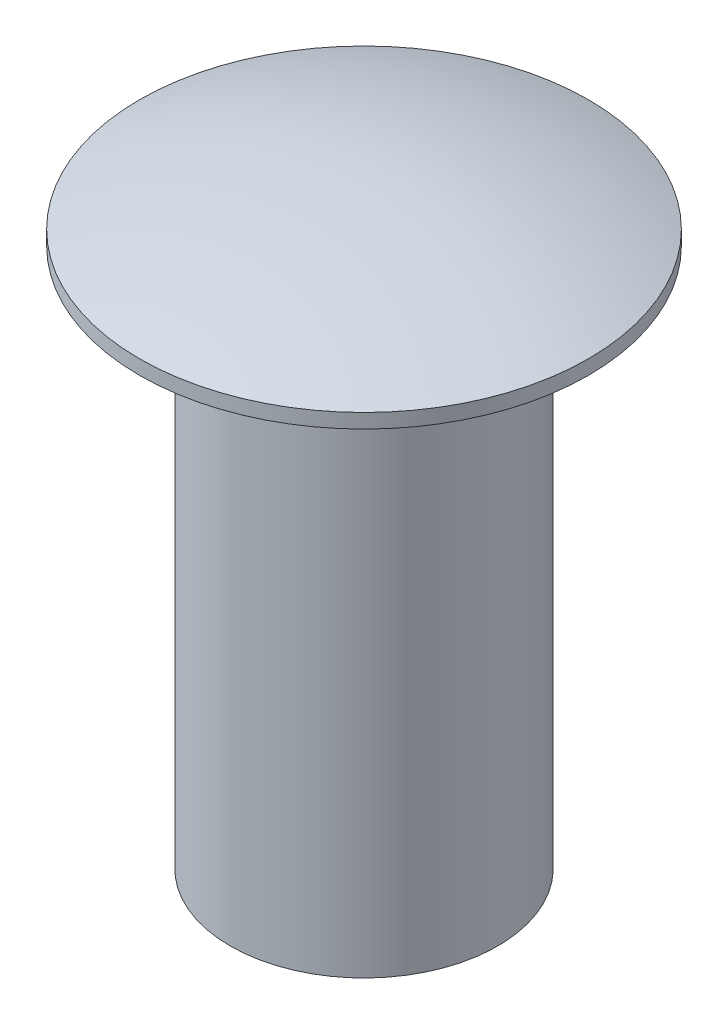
ISO-10303-21;
HEADER;
FILE_DESCRIPTION(('STEP AP214'),'2;1');
FILE_NAME('part.step','',(''),(''),'','','');
FILE_SCHEMA(('AUTOMOTIVE_DESIGN { 1 0 10303 214 1 1 1 1 }'));
ENDSEC;
DATA;
#1=APPLICATION_CONTEXT('core data for automotive mechanical design processes');
#2=APPLICATION_PROTOCOL_DEFINITION('international standard','automotive_design',2000,#1);
#3=PRODUCT_CONTEXT('',#1,'mechanical');
#4=PRODUCT('Part','Part','',(#3));
#5=PRODUCT_RELATED_PRODUCT_CATEGORY('part','',(#4));
#6=PRODUCT_DEFINITION_FORMATION('','',#4);
#7=PRODUCT_DEFINITION_CONTEXT('part definition',#1,'design');
#8=PRODUCT_DEFINITION('design','',#6,#7);
#9=PRODUCT_DEFINITION_SHAPE('','',#8);
#10=(LENGTH_UNIT() NAMED_UNIT(*) SI_UNIT(.MILLI.,.METRE.));
#11=(NAMED_UNIT(*) PLANE_ANGLE_UNIT() SI_UNIT($,.RADIAN.));
#12=(NAMED_UNIT(*) SI_UNIT($,.STERADIAN.) SOLID_ANGLE_UNIT());
#13=UNCERTAINTY_MEASURE_WITH_UNIT(LENGTH_MEASURE(1.E-05),#10,'distance_accuracy_value','');
#14=(GEOMETRIC_REPRESENTATION_CONTEXT(3) GLOBAL_UNCERTAINTY_ASSIGNED_CONTEXT((#13)) GLOBAL_UNIT_ASSIGNED_CONTEXT((#10,
#11,#12)) REPRESENTATION_CONTEXT('',''));
#15=CARTESIAN_POINT('',(0.,0.,0.));
#16=DIRECTION('',(0.,0.,1.));
#17=DIRECTION('',(1.,0.,0.));
#18=AXIS2_PLACEMENT_3D('',#15,#16,#17);
#19=CARTESIAN_POINT('',(0.,4.7625,0.));
#20=DIRECTION('',(0.,-1.,0.));
#21=DIRECTION('',(0.,0.,-1.));
#22=AXIS2_PLACEMENT_3D('',#19,#20,#21);
#23=CYLINDRICAL_SURFACE('',#22,1.1811);
#24=CARTESIAN_POINT('',(0.,4.7625,0.));
#25=DIRECTION('',(0.,1.,0.));
#26=DIRECTION('',(0.,0.,1.));
#27=AXIS2_PLACEMENT_3D('',#24,#25,#26);
#28=CIRCLE('',#27,1.1811);
#29=CARTESIAN_POINT('',(0.,4.7625,-1.1811));
#30=VERTEX_POINT('',#29);
#31=EDGE_CURVE('E10',#30,#30,#28,.T.);
#32=CARTESIAN_POINT('',(0.,0.,0.));
#33=DIRECTION('',(0.,1.,0.));
#34=DIRECTION('',(0.,0.,1.));
#35=AXIS2_PLACEMENT_3D('',#32,#33,#34);
#36=CIRCLE('',#35,1.1811);
#37=CARTESIAN_POINT('',(0.,0.,-1.1811));
#38=VERTEX_POINT('',#37);
#39=EDGE_CURVE('E41',#38,#38,#36,.T.);
#40=CARTESIAN_POINT('',(0.,4.7625,-1.1811));
#41=CARTESIAN_POINT('',(0.,4.712890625,-1.1811));
#42=CARTESIAN_POINT('',(0.,4.66328125,-1.1811));
#43=CARTESIAN_POINT('',(0.,4.5640625,-1.1811));
#44=CARTESIAN_POINT('',(0.,4.514453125,-1.1811));
#45=CARTESIAN_POINT('',(0.,4.415234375,-1.1811));
#46=CARTESIAN_POINT('',(0.,4.365625,-1.1811));
#47=CARTESIAN_POINT('',(0.,4.26640625,-1.1811));
#48=CARTESIAN_POINT('',(0.,4.216796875,-1.1811));
#49=CARTESIAN_POINT('',(0.,4.117578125,-1.1811));
#50=CARTESIAN_POINT('',(0.,4.06796875,-1.1811));
#51=CARTESIAN_POINT('',(0.,3.96875,-1.1811));
#52=CARTESIAN_POINT('',(0.,3.919140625,-1.1811));
#53=CARTESIAN_POINT('',(0.,3.819921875,-1.1811));
#54=CARTESIAN_POINT('',(0.,3.7703125,-1.1811));
#55=CARTESIAN_POINT('',(0.,3.67109375,-1.1811));
#56=CARTESIAN_POINT('',(0.,3.621484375,-1.1811));
#57=CARTESIAN_POINT('',(0.,3.522265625,-1.1811));
#58=CARTESIAN_POINT('',(0.,3.47265625,-1.1811));
#59=CARTESIAN_POINT('',(0.,3.3734375,-1.1811));
#60=CARTESIAN_POINT('',(0.,3.323828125,-1.1811));
#61=CARTESIAN_POINT('',(0.,3.224609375,-1.1811));
#62=CARTESIAN_POINT('',(0.,3.175,-1.1811));
#63=CARTESIAN_POINT('',(0.,3.07578125,-1.1811));
#64=CARTESIAN_POINT('',(0.,3.026171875,-1.1811));
#65=CARTESIAN_POINT('',(0.,2.926953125,-1.1811));
#66=CARTESIAN_POINT('',(0.,2.87734375,-1.1811));
#67=CARTESIAN_POINT('',(0.,2.778125,-1.1811));
#68=CARTESIAN_POINT('',(0.,2.728515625,-1.1811));
#69=CARTESIAN_POINT('',(0.,2.629296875,-1.1811));
#70=CARTESIAN_POINT('',(0.,2.5796875,-1.1811));
#71=CARTESIAN_POINT('',(0.,2.48046875,-1.1811));
#72=CARTESIAN_POINT('',(0.,2.430859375,-1.1811));
#73=CARTESIAN_POINT('',(0.,2.331640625,-1.1811));
#74=CARTESIAN_POINT('',(0.,2.28203125,-1.1811));
#75=CARTESIAN_POINT('',(0.,2.1828125,-1.1811));
#76=CARTESIAN_POINT('',(0.,2.133203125,-1.1811));
#77=CARTESIAN_POINT('',(0.,2.033984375,-1.1811));
#78=CARTESIAN_POINT('',(0.,1.984375,-1.1811));
#79=CARTESIAN_POINT('',(0.,1.88515625,-1.1811));
#80=CARTESIAN_POINT('',(0.,1.835546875,-1.1811));
#81=CARTESIAN_POINT('',(0.,1.736328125,-1.1811));
#82=CARTESIAN_POINT('',(0.,1.68671875,-1.1811));
#83=CARTESIAN_POINT('',(0.,1.5875,-1.1811));
#84=CARTESIAN_POINT('',(0.,1.537890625,-1.1811));
#85=CARTESIAN_POINT('',(0.,1.438671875,-1.1811));
#86=CARTESIAN_POINT('',(0.,1.3890625,-1.1811));
#87=CARTESIAN_POINT('',(0.,1.28984375,-1.1811));
#88=CARTESIAN_POINT('',(0.,1.240234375,-1.1811));
#89=CARTESIAN_POINT('',(0.,1.141015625,-1.1811));
#90=CARTESIAN_POINT('',(0.,1.09140625,-1.1811));
#91=CARTESIAN_POINT('',(0.,0.992187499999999,-1.1811));
#92=CARTESIAN_POINT('',(0.,0.942578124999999,-1.1811));
#93=CARTESIAN_POINT('',(0.,0.843359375,-1.1811));
#94=CARTESIAN_POINT('',(0.,0.79375,-1.1811));
#95=CARTESIAN_POINT('',(0.,0.69453125,-1.1811));
#96=CARTESIAN_POINT('',(0.,0.644921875,-1.1811));
#97=CARTESIAN_POINT('',(0.,0.545703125,-1.1811));
#98=CARTESIAN_POINT('',(0.,0.49609375,-1.1811));
#99=CARTESIAN_POINT('',(0.,0.396875,-1.1811));
#100=CARTESIAN_POINT('',(0.,0.347265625,-1.1811));
#101=CARTESIAN_POINT('',(0.,0.248046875,-1.1811));
#102=CARTESIAN_POINT('',(0.,0.1984375,-1.1811));
#103=CARTESIAN_POINT('',(0.,0.09921875,-1.1811));
#104=CARTESIAN_POINT('',(0.,0.049609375,-1.1811));
#105=CARTESIAN_POINT('',(0.,0.,-1.1811));
#106=B_SPLINE_CURVE_WITH_KNOTS('',3,(#40,#41,#42,#43,#44,#45,#46,#47,#48,#49,#50,#51,#52,#53,
#54,#55,#56,#57,#58,#59,#60,#61,#62,#63,#64,#65,#66,#67,#68,#69,#70,#71,#72,#73,#74,#75,#76,#77,
#78,#79,#80,#81,#82,#83,#84,#85,#86,#87,#88,#89,#90,#91,#92,#93,#94,#95,#96,#97,#98,#99,#100,
#101,#102,#103,#104,#105),.UNSPECIFIED.,.F.,.F.,(4,2,2,2,2,2,2,2,2,2,2,2,2,2,2,2,2,2,2,2,2,2,2,
2,2,2,2,2,2,2,2,2,4),(0.,0.148828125,0.29765625,0.446484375,0.5953125,0.744140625,
0.892968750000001,1.041796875,1.190625,1.339453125,1.48828125,1.637109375,1.7859375,1.934765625,
2.08359375,2.232421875,2.38125,2.530078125,2.67890625,2.827734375,2.9765625,3.125390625,
3.27421875,3.423046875,3.571875,3.720703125,3.86953125,4.018359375,4.1671875,4.316015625,
4.46484375,4.613671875,4.7625),.UNSPECIFIED.);
#107=EDGE_CURVE('BSEAM33',#30,#38,#106,.T.);
#108=ORIENTED_EDGE('',*,*,#31,.F.);
#109=ORIENTED_EDGE('',*,*,#39,.T.);
#110=ORIENTED_EDGE('',*,*,#107,.T.);
#111=ORIENTED_EDGE('',*,*,#107,.F.);
#112=EDGE_LOOP('',(#108,#110,#109,#111));
#113=FACE_BOUND('',#112,.T.);
#114=ADVANCED_FACE('F33',(#113),#23,.T.);
#115=CARTESIAN_POINT('',(0.,0.,0.));
#116=DIRECTION('',(0.,1.,0.));
#117=DIRECTION('',(0.,0.,1.));
#118=AXIS2_PLACEMENT_3D('',#115,#116,#117);
#119=PLANE('',#118);
#120=CARTESIAN_POINT('',(0.,0.,0.));
#121=DIRECTION('',(0.,-1.,0.));
#122=DIRECTION('',(0.,0.,-1.));
#123=AXIS2_PLACEMENT_3D('',#120,#121,#122);
#124=CIRCLE('',#123,0.943992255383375);
#125=CARTESIAN_POINT('',(0.,0.,-0.943992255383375));
#126=VERTEX_POINT('',#125);
#127=EDGE_CURVE('E51',#126,#126,#124,.T.);
#128=ORIENTED_EDGE('',*,*,#127,.F.);
#129=EDGE_LOOP('',(#128));
#130=FACE_BOUND('',#129,.T.);
#131=ORIENTED_EDGE('',*,*,#39,.F.);
#132=EDGE_LOOP('',(#131));
#133=FACE_BOUND('',#132,.T.);
#134=ADVANCED_FACE('F65',(#130,#133),#119,.F.);
#135=CARTESIAN_POINT('',(0.,4.7625,0.));
#136=DIRECTION('',(0.,1.,0.));
#137=DIRECTION('',(0.,0.,1.));
#138=AXIS2_PLACEMENT_3D('',#135,#136,#137);
#139=PLANE('',#138);
#140=CARTESIAN_POINT('',(0.,4.7625,0.));
#141=DIRECTION('',(0.,1.,0.));
#142=DIRECTION('',(0.,0.,1.));
#143=AXIS2_PLACEMENT_3D('',#140,#141,#142);
#144=CIRCLE('',#143,1.9812);
#145=CARTESIAN_POINT('',(0.,4.7625,1.9812));
#146=VERTEX_POINT('',#145);
#147=EDGE_CURVE('E47',#146,#146,#144,.T.);
#148=ORIENTED_EDGE('',*,*,#147,.F.);
#149=EDGE_LOOP('',(#148));
#150=FACE_BOUND('',#149,.T.);
#151=ORIENTED_EDGE('',*,*,#31,.T.);
#152=EDGE_LOOP('',(#151));
#153=FACE_BOUND('',#152,.T.);
#154=ADVANCED_FACE('F68',(#150,#153),#139,.F.);
#155=CARTESIAN_POINT('',(0.,4.8895,0.));
#156=DIRECTION('',(0.,-1.,0.));
#157=DIRECTION('',(0.,0.,-1.));
#158=AXIS2_PLACEMENT_3D('',#155,#156,#157);
#159=CYLINDRICAL_SURFACE('',#158,1.9812);
#160=CARTESIAN_POINT('',(0.,4.8895,0.));
#161=DIRECTION('',(0.,1.,0.));
#162=DIRECTION('',(0.,0.,1.));
#163=AXIS2_PLACEMENT_3D('',#160,#161,#162);
#164=CIRCLE('',#163,1.9812);
#165=CARTESIAN_POINT('',(0.,4.8895,1.9812));
#166=VERTEX_POINT('',#165);
#167=EDGE_CURVE('E37',#166,#166,#164,.T.);
#168=ORIENTED_EDGE('',*,*,#167,.F.);
#169=EDGE_LOOP('',(#168));
#170=FACE_BOUND('',#169,.T.);
#171=ORIENTED_EDGE('',*,*,#147,.T.);
#172=EDGE_LOOP('',(#171));
#173=FACE_BOUND('',#172,.T.);
#174=ADVANCED_FACE('F77',(#170,#173),#159,.T.);
#175=CARTESIAN_POINT('',(0.,-0.0711199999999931,0.));
#176=DIRECTION('',(0.,0.,1.));
#177=DIRECTION('',(1.,0.,0.));
#178=AXIS2_PLACEMENT_3D('',#175,#176,#177);
#179=SPHERICAL_SURFACE('',#178,5.34161999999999);
#180=CARTESIAN_POINT('',(0.,-0.0711199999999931,0.));
#181=DIRECTION('',(0.,1.,0.));
#182=DIRECTION('',(0.,0.,1.));
#183=AXIS2_PLACEMENT_3D('',#180,#181,#182);
#184=SPHERICAL_SURFACE('',#183,5.34161999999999);
#185=ORIENTED_EDGE('',*,*,#167,.T.);
#186=EDGE_LOOP('',(#185));
#187=FACE_BOUND('',#186,.T.);
#188=ADVANCED_FACE('F35',(#187),#184,.T.);
#189=CARTESIAN_POINT('',(0.,0.762,0.));
#190=DIRECTION('',(0.,-1.,0.));
#191=DIRECTION('',(0.,0.,-1.));
#192=AXIS2_PLACEMENT_3D('',#189,#190,#191);
#193=CYLINDRICAL_SURFACE('',#192,0.943992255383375);
#194=CARTESIAN_POINT('',(0.,0.762,0.));
#195=DIRECTION('',(0.,-1.,0.));
#196=DIRECTION('',(0.,0.,-1.));
#197=AXIS2_PLACEMENT_3D('',#194,#195,#196);
#198=CIRCLE('',#197,0.943992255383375);
#199=CARTESIAN_POINT('',(0.,0.762,-0.943992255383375));
#200=VERTEX_POINT('',#199);
#201=EDGE_CURVE('E50',#200,#200,#198,.T.);
#202=CARTESIAN_POINT('',(0.,0.762,-0.943992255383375));
#203=CARTESIAN_POINT('',(0.,0.7540625,-0.943992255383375));
#204=CARTESIAN_POINT('',(0.,0.746125,-0.943992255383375));
#205=CARTESIAN_POINT('',(0.,0.73025,-0.943992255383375));
#206=CARTESIAN_POINT('',(0.,0.7223125,-0.943992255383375));
#207=CARTESIAN_POINT('',(0.,0.7064375,-0.943992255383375));
#208=CARTESIAN_POINT('',(0.,0.6985,-0.943992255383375));
#209=CARTESIAN_POINT('',(0.,0.682625,-0.943992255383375));
#210=CARTESIAN_POINT('',(0.,0.6746875,-0.943992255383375));
#211=CARTESIAN_POINT('',(0.,0.6588125,-0.943992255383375));
#212=CARTESIAN_POINT('',(0.,0.650875,-0.943992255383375));
#213=CARTESIAN_POINT('',(0.,0.635,-0.943992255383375));
#214=CARTESIAN_POINT('',(0.,0.6270625,-0.943992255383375));
#215=CARTESIAN_POINT('',(0.,0.6111875,-0.943992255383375));
#216=CARTESIAN_POINT('',(0.,0.60325,-0.943992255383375));
#217=CARTESIAN_POINT('',(0.,0.587375,-0.943992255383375));
#218=CARTESIAN_POINT('',(0.,0.5794375,-0.943992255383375));
#219=CARTESIAN_POINT('',(0.,0.5635625,-0.943992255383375));
#220=CARTESIAN_POINT('',(0.,0.555625,-0.943992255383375));
#221=CARTESIAN_POINT('',(0.,0.53975,-0.943992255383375));
#222=CARTESIAN_POINT('',(0.,0.5318125,-0.943992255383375));
#223=CARTESIAN_POINT('',(0.,0.5159375,-0.943992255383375));
#224=CARTESIAN_POINT('',(0.,0.508,-0.943992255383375));
#225=CARTESIAN_POINT('',(0.,0.492125,-0.943992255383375));
#226=CARTESIAN_POINT('',(0.,0.4841875,-0.943992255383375));
#227=CARTESIAN_POINT('',(0.,0.4683125,-0.943992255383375));
#228=CARTESIAN_POINT('',(0.,0.460375,-0.943992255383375));
#229=CARTESIAN_POINT('',(0.,0.4445,-0.943992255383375));
#230=CARTESIAN_POINT('',(0.,0.4365625,-0.943992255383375));
#231=CARTESIAN_POINT('',(0.,0.4206875,-0.943992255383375));
#232=CARTESIAN_POINT('',(0.,0.41275,-0.943992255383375));
#233=CARTESIAN_POINT('',(0.,0.396875,-0.943992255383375));
#234=CARTESIAN_POINT('',(0.,0.3889375,-0.943992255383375));
#235=CARTESIAN_POINT('',(0.,0.3730625,-0.943992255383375));
#236=CARTESIAN_POINT('',(0.,0.365125,-0.943992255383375));
#237=CARTESIAN_POINT('',(0.,0.34925,-0.943992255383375));
#238=CARTESIAN_POINT('',(0.,0.3413125,-0.943992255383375));
#239=CARTESIAN_POINT('',(0.,0.3254375,-0.943992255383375));
#240=CARTESIAN_POINT('',(0.,0.3175,-0.943992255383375));
#241=CARTESIAN_POINT('',(0.,0.301625,-0.943992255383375));
#242=CARTESIAN_POINT('',(0.,0.2936875,-0.943992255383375));
#243=CARTESIAN_POINT('',(0.,0.2778125,-0.943992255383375));
#244=CARTESIAN_POINT('',(0.,0.269875,-0.943992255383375));
#245=CARTESIAN_POINT('',(0.,0.254,-0.943992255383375));
#246=CARTESIAN_POINT('',(0.,0.2460625,-0.943992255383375));
#247=CARTESIAN_POINT('',(0.,0.2301875,-0.943992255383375));
#248=CARTESIAN_POINT('',(0.,0.22225,-0.943992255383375));
#249=CARTESIAN_POINT('',(0.,0.206375,-0.943992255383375));
#250=CARTESIAN_POINT('',(0.,0.1984375,-0.943992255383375));
#251=CARTESIAN_POINT('',(0.,0.1825625,-0.943992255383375));
#252=CARTESIAN_POINT('',(0.,0.174625,-0.943992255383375));
#253=CARTESIAN_POINT('',(0.,0.15875,-0.943992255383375));
#254=CARTESIAN_POINT('',(0.,0.1508125,-0.943992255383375));
#255=CARTESIAN_POINT('',(0.,0.1349375,-0.943992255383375));
#256=CARTESIAN_POINT('',(0.,0.127,-0.943992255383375));
#257=CARTESIAN_POINT('',(0.,0.111125,-0.943992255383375));
#258=CARTESIAN_POINT('',(0.,0.1031875,-0.943992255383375));
#259=CARTESIAN_POINT('',(0.,0.0873125,-0.943992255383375));
#260=CARTESIAN_POINT('',(0.,0.079375,-0.943992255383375));
#261=CARTESIAN_POINT('',(0.,0.0635,-0.943992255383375));
#262=CARTESIAN_POINT('',(0.,0.0555625,-0.943992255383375));
#263=CARTESIAN_POINT('',(0.,0.0396875,-0.943992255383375));
#264=CARTESIAN_POINT('',(0.,0.03175,-0.943992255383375));
#265=CARTESIAN_POINT('',(0.,0.015875,-0.943992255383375));
#266=CARTESIAN_POINT('',(0.,0.00793749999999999,-0.943992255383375));
#267=CARTESIAN_POINT('',(0.,0.,-0.943992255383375));
#268=B_SPLINE_CURVE_WITH_KNOTS('',3,(#202,#203,#204,#205,#206,#207,#208,#209,#210,#211,#212,
#213,#214,#215,#216,#217,#218,#219,#220,#221,#222,#223,#224,#225,#226,#227,#228,#229,#230,#231,
#232,#233,#234,#235,#236,#237,#238,#239,#240,#241,#242,#243,#244,#245,#246,#247,#248,#249,#250,
#251,#252,#253,#254,#255,#256,#257,#258,#259,#260,#261,#262,#263,#264,#265,#266,#267),
.UNSPECIFIED.,.F.,.F.,(4,2,2,2,2,2,2,2,2,2,2,2,2,2,2,2,2,2,2,2,2,2,2,2,2,2,2,2,2,2,2,2,4),(0.,
0.0238125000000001,0.047625,0.0714375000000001,0.0952500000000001,0.1190625,0.142875,0.1666875,
0.1905,0.2143125,0.238125,0.2619375,0.28575,0.3095625,0.333375,0.3571875,0.381,0.4048125,
0.428625,0.4524375,0.47625,0.5000625,0.523875,0.5476875,0.5715,0.5953125,0.619125,0.6429375,
0.66675,0.6905625,0.714375,0.7381875,0.762),.UNSPECIFIED.);
#269=EDGE_CURVE('BSEAM59',#200,#126,#268,.T.);
#270=ORIENTED_EDGE('',*,*,#201,.F.);
#271=ORIENTED_EDGE('',*,*,#127,.T.);
#272=ORIENTED_EDGE('',*,*,#269,.T.);
#273=ORIENTED_EDGE('',*,*,#269,.F.);
#274=EDGE_LOOP('',(#270,#272,#271,#273));
#275=FACE_BOUND('',#274,.T.);
#276=ADVANCED_FACE('F59',(#275),#193,.F.);
#277=CARTESIAN_POINT('',(0.,0.762,0.));
#278=DIRECTION('',(0.,-1.,0.));
#279=DIRECTION('',(0.,0.,-1.));
#280=AXIS2_PLACEMENT_3D('',#277,#278,#279);
#281=PLANE('',#280);
#282=ORIENTED_EDGE('',*,*,#201,.T.);
#283=EDGE_LOOP('',(#282));
#284=FACE_BOUND('',#283,.T.);
#285=ADVANCED_FACE('F57',(#284),#281,.T.);
#286=CLOSED_SHELL('',(#114,#134,#154,#174,#188,#276,#285));
#287=MANIFOLD_SOLID_BREP('B2',#286);
#288=ADVANCED_BREP_SHAPE_REPRESENTATION('',(#18,#287),#14);
#289=SHAPE_DEFINITION_REPRESENTATION(#9,#288);
ENDSEC;
END-ISO-10303-21;
